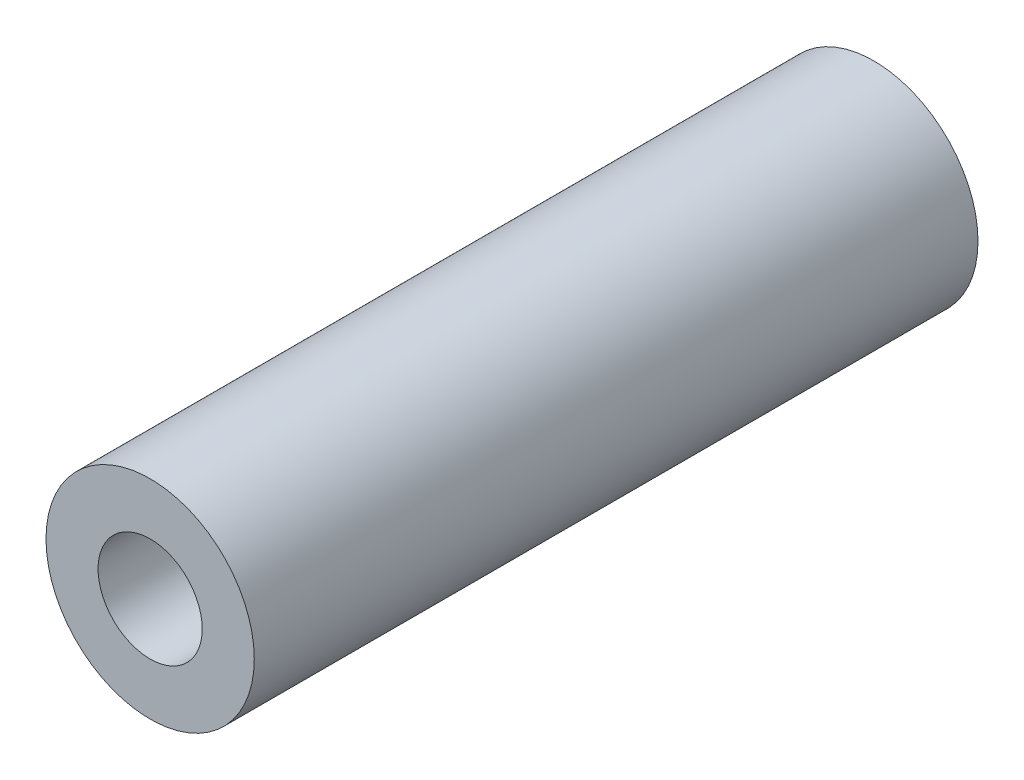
ISO-10303-21;
HEADER;
FILE_DESCRIPTION(('STEP AP214'),'2;1');
FILE_NAME('part.step','',(''),(''),'','','');
FILE_SCHEMA(('AUTOMOTIVE_DESIGN { 1 0 10303 214 1 1 1 1 }'));
ENDSEC;
DATA;
#1=APPLICATION_CONTEXT('core data for automotive mechanical design processes');
#2=APPLICATION_PROTOCOL_DEFINITION('international standard','automotive_design',2000,#1);
#3=PRODUCT_CONTEXT('',#1,'mechanical');
#4=PRODUCT('Part','Part','',(#3));
#5=PRODUCT_RELATED_PRODUCT_CATEGORY('part','',(#4));
#6=PRODUCT_DEFINITION_FORMATION('','',#4);
#7=PRODUCT_DEFINITION_CONTEXT('part definition',#1,'design');
#8=PRODUCT_DEFINITION('design','',#6,#7);
#9=PRODUCT_DEFINITION_SHAPE('','',#8);
#10=(LENGTH_UNIT() NAMED_UNIT(*) SI_UNIT(.MILLI.,.METRE.));
#11=(NAMED_UNIT(*) PLANE_ANGLE_UNIT() SI_UNIT($,.RADIAN.));
#12=(NAMED_UNIT(*) SI_UNIT($,.STERADIAN.) SOLID_ANGLE_UNIT());
#13=UNCERTAINTY_MEASURE_WITH_UNIT(LENGTH_MEASURE(1.E-05),#10,'distance_accuracy_value','');
#14=(GEOMETRIC_REPRESENTATION_CONTEXT(3) GLOBAL_UNCERTAINTY_ASSIGNED_CONTEXT((#13)) GLOBAL_UNIT_ASSIGNED_CONTEXT((#10,
#11,#12)) REPRESENTATION_CONTEXT('',''));
#15=CARTESIAN_POINT('',(0.,0.,0.));
#16=DIRECTION('',(0.,0.,1.));
#17=DIRECTION('',(1.,0.,0.));
#18=AXIS2_PLACEMENT_3D('',#15,#16,#17);
#19=CARTESIAN_POINT('',(0.,0.,139.));
#20=DIRECTION('',(0.,0.,1.));
#21=DIRECTION('',(1.,0.,0.));
#22=AXIS2_PLACEMENT_3D('',#19,#20,#21);
#23=PLANE('',#22);
#24=CARTESIAN_POINT('',(0.,0.,139.));
#25=DIRECTION('',(0.,0.,1.));
#26=DIRECTION('',(1.,0.,0.));
#27=AXIS2_PLACEMENT_3D('',#24,#25,#26);
#28=CIRCLE('',#27,20.);
#29=CARTESIAN_POINT('',(20.,0.,139.));
#30=VERTEX_POINT('',#29);
#31=EDGE_CURVE('E9',#30,#30,#28,.T.);
#32=ORIENTED_EDGE('',*,*,#31,.T.);
#33=EDGE_LOOP('',(#32));
#34=FACE_BOUND('',#33,.T.);
#35=CARTESIAN_POINT('',(0.,0.,139.));
#36=DIRECTION('',(0.,0.,1.));
#37=DIRECTION('',(1.,0.,0.));
#38=AXIS2_PLACEMENT_3D('',#35,#36,#37);
#39=CIRCLE('',#38,10.);
#40=CARTESIAN_POINT('',(10.,0.,139.));
#41=VERTEX_POINT('',#40);
#42=EDGE_CURVE('E25',#41,#41,#39,.T.);
#43=ORIENTED_EDGE('',*,*,#42,.F.);
#44=EDGE_LOOP('',(#43));
#45=FACE_BOUND('',#44,.T.);
#46=ADVANCED_FACE('F14',(#34,#45),#23,.T.);
#47=CARTESIAN_POINT('',(0.,0.,0.));
#48=DIRECTION('',(0.,0.,1.));
#49=DIRECTION('',(1.,0.,0.));
#50=AXIS2_PLACEMENT_3D('',#47,#48,#49);
#51=PLANE('',#50);
#52=CARTESIAN_POINT('',(0.,0.,0.));
#53=DIRECTION('',(0.,0.,1.));
#54=DIRECTION('',(1.,0.,0.));
#55=AXIS2_PLACEMENT_3D('',#52,#53,#54);
#56=CIRCLE('',#55,20.);
#57=CARTESIAN_POINT('',(20.,0.,0.));
#58=VERTEX_POINT('',#57);
#59=EDGE_CURVE('E18',#58,#58,#56,.T.);
#60=ORIENTED_EDGE('',*,*,#59,.F.);
#61=EDGE_LOOP('',(#60));
#62=FACE_BOUND('',#61,.T.);
#63=CARTESIAN_POINT('',(0.,0.,0.));
#64=DIRECTION('',(0.,0.,1.));
#65=DIRECTION('',(1.,0.,0.));
#66=AXIS2_PLACEMENT_3D('',#63,#64,#65);
#67=CIRCLE('',#66,10.);
#68=CARTESIAN_POINT('',(10.,0.,0.));
#69=VERTEX_POINT('',#68);
#70=EDGE_CURVE('E27',#69,#69,#67,.T.);
#71=ORIENTED_EDGE('',*,*,#70,.T.);
#72=EDGE_LOOP('',(#71));
#73=FACE_BOUND('',#72,.T.);
#74=ADVANCED_FACE('F37',(#62,#73),#51,.F.);
#75=CARTESIAN_POINT('',(0.,0.,139.));
#76=DIRECTION('',(0.,0.,-1.));
#77=DIRECTION('',(-1.,0.,0.));
#78=AXIS2_PLACEMENT_3D('',#75,#76,#77);
#79=CYLINDRICAL_SURFACE('',#78,20.);
#80=ORIENTED_EDGE('',*,*,#31,.F.);
#81=EDGE_LOOP('',(#80));
#82=FACE_BOUND('',#81,.T.);
#83=ORIENTED_EDGE('',*,*,#59,.T.);
#84=EDGE_LOOP('',(#83));
#85=FACE_BOUND('',#84,.T.);
#86=ADVANCED_FACE('F16',(#82,#85),#79,.T.);
#87=CARTESIAN_POINT('',(0.,0.,139.));
#88=DIRECTION('',(0.,0.,-1.));
#89=DIRECTION('',(-1.,0.,0.));
#90=AXIS2_PLACEMENT_3D('',#87,#88,#89);
#91=CYLINDRICAL_SURFACE('',#90,10.);
#92=ORIENTED_EDGE('',*,*,#42,.T.);
#93=EDGE_LOOP('',(#92));
#94=FACE_BOUND('',#93,.T.);
#95=ORIENTED_EDGE('',*,*,#70,.F.);
#96=EDGE_LOOP('',(#95));
#97=FACE_BOUND('',#96,.T.);
#98=ADVANCED_FACE('F33',(#94,#97),#91,.F.);
#99=CLOSED_SHELL('',(#46,#74,#86,#98));
#100=MANIFOLD_SOLID_BREP('B1',#99);
#101=ADVANCED_BREP_SHAPE_REPRESENTATION('',(#18,#100),#14);
#102=SHAPE_DEFINITION_REPRESENTATION(#9,#101);
ENDSEC;
END-ISO-10303-21;
